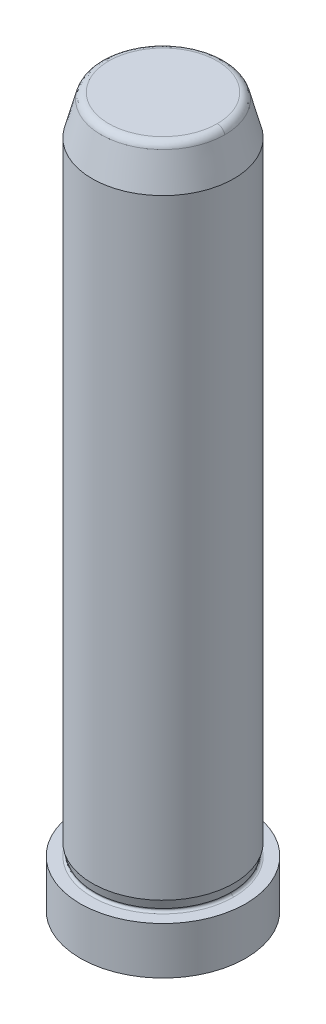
ISO-10303-21;
HEADER;
FILE_DESCRIPTION(('STEP AP214'),'2;1');
FILE_NAME('part.step','',(''),(''),'','','');
FILE_SCHEMA(('AUTOMOTIVE_DESIGN { 1 0 10303 214 1 1 1 1 }'));
ENDSEC;
DATA;
#1=APPLICATION_CONTEXT('core data for automotive mechanical design processes');
#2=APPLICATION_PROTOCOL_DEFINITION('international standard','automotive_design',2000,#1);
#3=PRODUCT_CONTEXT('',#1,'mechanical');
#4=PRODUCT('Part','Part','',(#3));
#5=PRODUCT_RELATED_PRODUCT_CATEGORY('part','',(#4));
#6=PRODUCT_DEFINITION_FORMATION('','',#4);
#7=PRODUCT_DEFINITION_CONTEXT('part definition',#1,'design');
#8=PRODUCT_DEFINITION('design','',#6,#7);
#9=PRODUCT_DEFINITION_SHAPE('','',#8);
#10=(LENGTH_UNIT() NAMED_UNIT(*) SI_UNIT(.MILLI.,.METRE.));
#11=(NAMED_UNIT(*) PLANE_ANGLE_UNIT() SI_UNIT($,.RADIAN.));
#12=(NAMED_UNIT(*) SI_UNIT($,.STERADIAN.) SOLID_ANGLE_UNIT());
#13=UNCERTAINTY_MEASURE_WITH_UNIT(LENGTH_MEASURE(1.E-05),#10,'distance_accuracy_value','');
#14=(GEOMETRIC_REPRESENTATION_CONTEXT(3) GLOBAL_UNCERTAINTY_ASSIGNED_CONTEXT((#13)) GLOBAL_UNIT_ASSIGNED_CONTEXT((#10,
#11,#12)) REPRESENTATION_CONTEXT('',''));
#15=CARTESIAN_POINT('',(0.,0.,0.));
#16=DIRECTION('',(0.,0.,1.));
#17=DIRECTION('',(1.,0.,0.));
#18=AXIS2_PLACEMENT_3D('',#15,#16,#17);
#19=CARTESIAN_POINT('',(-55.626,-159.,-31.374));
#20=DIRECTION('',(0.,-1.,0.));
#21=DIRECTION('',(0.,0.,-1.));
#22=AXIS2_PLACEMENT_3D('',#19,#20,#21);
#23=PLANE('',#22);
#24=CARTESIAN_POINT('',(-45.,-159.,-42.));
#25=DIRECTION('',(0.,-1.,0.));
#26=DIRECTION('',(0.,0.,-1.));
#27=AXIS2_PLACEMENT_3D('',#24,#25,#26);
#28=CIRCLE('',#27,10.5);
#29=CARTESIAN_POINT('',(-45.,-159.,-52.5));
#30=VERTEX_POINT('',#29);
#31=EDGE_CURVE('E29',#30,#30,#28,.T.);
#32=ORIENTED_EDGE('',*,*,#31,.T.);
#33=EDGE_LOOP('',(#32));
#34=FACE_BOUND('',#33,.T.);
#35=ADVANCED_FACE('F24',(#34),#23,.T.);
#36=CARTESIAN_POINT('',(-45.,-153.,-42.));
#37=DIRECTION('',(0.,-1.,0.));
#38=DIRECTION('',(0.,0.,-1.));
#39=AXIS2_PLACEMENT_3D('',#36,#37,#38);
#40=CYLINDRICAL_SURFACE('',#39,10.5);
#41=ORIENTED_EDGE('',*,*,#31,.F.);
#42=EDGE_LOOP('',(#41));
#43=FACE_BOUND('',#42,.T.);
#44=CARTESIAN_POINT('',(-45.,-153.,-42.));
#45=DIRECTION('',(0.,-1.,0.));
#46=DIRECTION('',(0.,0.,-1.));
#47=AXIS2_PLACEMENT_3D('',#44,#45,#46);
#48=CIRCLE('',#47,10.5);
#49=CARTESIAN_POINT('',(-45.,-153.,-52.5));
#50=VERTEX_POINT('',#49);
#51=EDGE_CURVE('E81',#50,#50,#48,.F.);
#52=ORIENTED_EDGE('',*,*,#51,.F.);
#53=EDGE_LOOP('',(#52));
#54=FACE_BOUND('',#53,.T.);
#55=ADVANCED_FACE('F162',(#43,#54),#40,.T.);
#56=CARTESIAN_POINT('',(-34.374,-153.,-52.626));
#57=DIRECTION('',(0.,1.,0.));
#58=DIRECTION('',(-1.,0.,0.));
#59=AXIS2_PLACEMENT_3D('',#56,#57,#58);
#60=PLANE('',#59);
#61=CARTESIAN_POINT('',(-53.9999999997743,-153.000000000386,-42.));
#62=CARTESIAN_POINT('',(-53.9999999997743,-153.000000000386,-24.0000000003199));
#63=CARTESIAN_POINT('',(-36.0000000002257,-153.000000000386,-24.0000000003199));
#64=CARTESIAN_POINT('',(-36.0000000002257,-153.000000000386,-42.));
#65=(BOUNDED_CURVE() B_SPLINE_CURVE(3,(#61,#62,#63,#64),.UNSPECIFIED.,.F.,
.F.) B_SPLINE_CURVE_WITH_KNOTS((4,4),(0.,1.),
.UNSPECIFIED.) CURVE() GEOMETRIC_REPRESENTATION_ITEM() RATIONAL_B_SPLINE_CURVE((0.956578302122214,
0.318859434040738,0.318859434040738,0.956578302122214)) REPRESENTATION_ITEM(''));
#66=CARTESIAN_POINT('',(-35.9999999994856,-153.000000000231,-42.));
#67=VERTEX_POINT('',#66);
#68=CARTESIAN_POINT('',(-54.0000000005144,-153.000000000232,-42.));
#69=VERTEX_POINT('',#68);
#70=EDGE_CURVE('E60',#67,#69,#65,.F.);
#71=ORIENTED_EDGE('',*,*,#70,.T.);
#72=CARTESIAN_POINT('',(-36.0000000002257,-153.000000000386,-42.));
#73=CARTESIAN_POINT('',(-36.0000000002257,-153.000000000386,-59.9999999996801));
#74=CARTESIAN_POINT('',(-53.9999999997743,-153.000000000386,-59.9999999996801));
#75=CARTESIAN_POINT('',(-53.9999999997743,-153.000000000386,-42.));
#76=(BOUNDED_CURVE() B_SPLINE_CURVE(3,(#72,#73,#74,#75),.UNSPECIFIED.,.F.,
.F.) B_SPLINE_CURVE_WITH_KNOTS((4,4),(0.,1.),
.UNSPECIFIED.) CURVE() GEOMETRIC_REPRESENTATION_ITEM() RATIONAL_B_SPLINE_CURVE((0.956578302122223,
0.318859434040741,0.318859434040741,0.956578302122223)) REPRESENTATION_ITEM(''));
#77=EDGE_CURVE('E64',#69,#67,#76,.F.);
#78=ORIENTED_EDGE('',*,*,#77,.T.);
#79=EDGE_LOOP('',(#71,#78));
#80=FACE_BOUND('',#79,.T.);
#81=ORIENTED_EDGE('',*,*,#51,.T.);
#82=EDGE_LOOP('',(#81));
#83=FACE_BOUND('',#82,.T.);
#84=ADVANCED_FACE('F66',(#80,#83),#60,.T.);
#85=CARTESIAN_POINT('',(-54.029950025,-152.99850125,-42.));
#86=CARTESIAN_POINT('',(-54.029950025,-152.99850125,-23.94009995));
#87=CARTESIAN_POINT('',(-35.970049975,-152.99850125,-23.94009995));
#88=CARTESIAN_POINT('',(-35.970049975,-152.99850125,-42.));
#89=CARTESIAN_POINT('',(-53.82598387,-153.018966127,-42.));
#90=CARTESIAN_POINT('',(-53.82598387,-153.018966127,-24.348032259));
#91=CARTESIAN_POINT('',(-36.17401613,-153.018966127,-24.348032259));
#92=CARTESIAN_POINT('',(-36.17401613,-153.018966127,-42.));
#93=CARTESIAN_POINT('',(-53.681033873,-152.87401613,-42.));
#94=CARTESIAN_POINT('',(-53.681033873,-152.87401613,-24.637932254));
#95=CARTESIAN_POINT('',(-36.318966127,-152.87401613,-24.637932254));
#96=CARTESIAN_POINT('',(-36.318966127,-152.87401613,-42.));
#97=CARTESIAN_POINT('',(-53.70149875,-152.670049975,-42.));
#98=CARTESIAN_POINT('',(-53.70149875,-152.670049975,-24.597002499));
#99=CARTESIAN_POINT('',(-36.29850125,-152.670049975,-24.597002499));
#100=CARTESIAN_POINT('',(-36.29850125,-152.670049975,-42.));
#101=(BOUNDED_SURFACE() B_SPLINE_SURFACE(3,3,((#85,#86,#87,#88),(#89,#90,#91,#92),(#93,#94,#95,
#96),(#97,#98,#99,#100)),.UNSPECIFIED.,.F.,.F.,.F.) B_SPLINE_SURFACE_WITH_KNOTS((4,4),(4,4),(0.,
1.),(0.,1.),.UNSPECIFIED.) GEOMETRIC_REPRESENTATION_ITEM() RATIONAL_B_SPLINE_SURFACE(((1.,
0.333333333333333,0.333333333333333,1.),(0.755320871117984,0.251773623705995,0.251773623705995,
0.755320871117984),(0.755320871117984,0.251773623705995,0.251773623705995,0.755320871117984),
(1.,0.333333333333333,0.333333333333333,1.))) REPRESENTATION_ITEM('') SURFACE());
#102=CARTESIAN_POINT('',(-45.,-152.7,-42.));
#103=DIRECTION('',(0.,-1.,0.));
#104=DIRECTION('',(-1.,0.,0.));
#105=AXIS2_PLACEMENT_3D('',#102,#103,#104);
#106=CIRCLE('',#105,8.70000000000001);
#107=CARTESIAN_POINT('',(-36.3000000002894,-152.700000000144,-41.9999999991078));
#108=VERTEX_POINT('',#107);
#109=CARTESIAN_POINT('',(-53.6999999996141,-152.700000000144,-42.));
#110=VERTEX_POINT('',#109);
#111=EDGE_CURVE('E88',#108,#110,#106,.T.);
#112=CARTESIAN_POINT('',(-54.029950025,-152.99850125,-42.));
#113=CARTESIAN_POINT('',(-53.82598387,-153.018966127,-42.));
#114=CARTESIAN_POINT('',(-53.681033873,-152.87401613,-42.));
#115=CARTESIAN_POINT('',(-53.70149875,-152.670049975,-42.));
#116=(BOUNDED_CURVE() B_SPLINE_CURVE(3,(#112,#113,#114,#115),.UNSPECIFIED.,.F.,
.F.) B_SPLINE_CURVE_WITH_KNOTS((4,4),(0.,1.),
.UNSPECIFIED.) CURVE() GEOMETRIC_REPRESENTATION_ITEM() RATIONAL_B_SPLINE_CURVE((1.,
0.755320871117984,0.755320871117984,1.)) REPRESENTATION_ITEM(''));
#117=EDGE_CURVE('E73',#110,#69,#116,.F.);
#118=CARTESIAN_POINT('',(-35.970049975,-152.99850125,-42.));
#119=CARTESIAN_POINT('',(-36.17401613,-153.018966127,-42.));
#120=CARTESIAN_POINT('',(-36.318966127,-152.87401613,-42.));
#121=CARTESIAN_POINT('',(-36.29850125,-152.670049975,-42.));
#122=(BOUNDED_CURVE() B_SPLINE_CURVE(3,(#118,#119,#120,#121),.UNSPECIFIED.,.F.,
.F.) B_SPLINE_CURVE_WITH_KNOTS((4,4),(0.,1.),
.UNSPECIFIED.) CURVE() GEOMETRIC_REPRESENTATION_ITEM() RATIONAL_B_SPLINE_CURVE((1.,
0.755320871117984,0.755320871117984,1.)) REPRESENTATION_ITEM(''));
#123=EDGE_CURVE('E72',#67,#108,#122,.T.);
#124=ORIENTED_EDGE('',*,*,#111,.T.);
#125=ORIENTED_EDGE('',*,*,#117,.T.);
#126=ORIENTED_EDGE('',*,*,#70,.F.);
#127=ORIENTED_EDGE('',*,*,#123,.T.);
#128=EDGE_LOOP('',(#124,#125,#126,#127));
#129=FACE_BOUND('',#128,.T.);
#130=ADVANCED_FACE('F79',(#129),#101,.F.);
#131=CARTESIAN_POINT('',(-35.970049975,-152.99850125,-42.));
#132=CARTESIAN_POINT('',(-35.970049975,-152.99850125,-60.05990005));
#133=CARTESIAN_POINT('',(-54.029950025,-152.99850125,-60.05990005));
#134=CARTESIAN_POINT('',(-54.029950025,-152.99850125,-42.));
#135=CARTESIAN_POINT('',(-36.17401613,-153.018966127,-42.));
#136=CARTESIAN_POINT('',(-36.17401613,-153.018966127,-59.651967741));
#137=CARTESIAN_POINT('',(-53.82598387,-153.018966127,-59.651967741));
#138=CARTESIAN_POINT('',(-53.82598387,-153.018966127,-42.));
#139=CARTESIAN_POINT('',(-36.318966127,-152.87401613,-42.));
#140=CARTESIAN_POINT('',(-36.318966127,-152.87401613,-59.362067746));
#141=CARTESIAN_POINT('',(-53.681033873,-152.87401613,-59.362067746));
#142=CARTESIAN_POINT('',(-53.681033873,-152.87401613,-42.));
#143=CARTESIAN_POINT('',(-36.29850125,-152.670049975,-42.));
#144=CARTESIAN_POINT('',(-36.29850125,-152.670049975,-59.402997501));
#145=CARTESIAN_POINT('',(-53.70149875,-152.670049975,-59.402997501));
#146=CARTESIAN_POINT('',(-53.70149875,-152.670049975,-42.));
#147=(BOUNDED_SURFACE() B_SPLINE_SURFACE(3,3,((#131,#132,#133,#134),(#135,#136,#137,#138),(#139,
#140,#141,#142),(#143,#144,#145,#146)),.UNSPECIFIED.,.F.,.F.,
.F.) B_SPLINE_SURFACE_WITH_KNOTS((4,4),(4,4),(0.,1.),(0.,1.),
.UNSPECIFIED.) GEOMETRIC_REPRESENTATION_ITEM() RATIONAL_B_SPLINE_SURFACE(((1.,0.333333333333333,
0.333333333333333,1.),(0.755320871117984,0.251773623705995,0.251773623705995,0.755320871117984),
(0.755320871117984,0.251773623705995,0.251773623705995,0.755320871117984),(1.,0.333333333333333,
0.333333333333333,1.))) REPRESENTATION_ITEM('') SURFACE());
#148=CARTESIAN_POINT('',(-45.,-152.7,-42.));
#149=DIRECTION('',(0.,-1.,0.));
#150=DIRECTION('',(-1.,0.,0.));
#151=AXIS2_PLACEMENT_3D('',#148,#149,#150);
#152=CIRCLE('',#151,8.70000000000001);
#153=EDGE_CURVE('E86',#110,#108,#152,.T.);
#154=ORIENTED_EDGE('',*,*,#77,.F.);
#155=ORIENTED_EDGE('',*,*,#117,.F.);
#156=ORIENTED_EDGE('',*,*,#153,.T.);
#157=ORIENTED_EDGE('',*,*,#123,.F.);
#158=EDGE_LOOP('',(#154,#155,#156,#157));
#159=FACE_BOUND('',#158,.T.);
#160=ADVANCED_FACE('F84',(#159),#147,.F.);
#161=CARTESIAN_POINT('',(-37.12013394,-69.838905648,-42.));
#162=CARTESIAN_POINT('',(-37.12013394,-69.838905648,-26.24026788));
#163=CARTESIAN_POINT('',(-52.87986606,-69.838905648,-26.24026788));
#164=CARTESIAN_POINT('',(-52.87986606,-69.838905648,-42.));
#165=CARTESIAN_POINT('',(-37.209940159,-69.288710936,-42.));
#166=CARTESIAN_POINT('',(-37.209940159,-69.288710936,-26.419880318));
#167=CARTESIAN_POINT('',(-52.790059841,-69.288710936,-26.419880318));
#168=CARTESIAN_POINT('',(-52.790059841,-69.288710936,-42.));
#169=CARTESIAN_POINT('',(-37.652215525,-68.949341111,-42.));
#170=CARTESIAN_POINT('',(-37.652215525,-68.949341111,-27.304431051));
#171=CARTESIAN_POINT('',(-52.347784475,-68.949341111,-27.304431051));
#172=CARTESIAN_POINT('',(-52.347784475,-68.949341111,-42.));
#173=CARTESIAN_POINT('',(-38.206906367,-69.004995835,-42.));
#174=CARTESIAN_POINT('',(-38.206906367,-69.004995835,-28.413812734));
#175=CARTESIAN_POINT('',(-51.793093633,-69.004995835,-28.413812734));
#176=CARTESIAN_POINT('',(-51.793093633,-69.004995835,-42.));
#177=(BOUNDED_SURFACE() B_SPLINE_SURFACE(3,3,((#161,#162,#163,#164),(#165,#166,#167,#168),(#169,
#170,#171,#172),(#173,#174,#175,#176)),.UNSPECIFIED.,.F.,.F.,
.F.) B_SPLINE_SURFACE_WITH_KNOTS((4,4),(4,4),(0.,1.),(0.,1.),
.UNSPECIFIED.) GEOMETRIC_REPRESENTATION_ITEM() RATIONAL_B_SPLINE_SURFACE(((1.,0.333333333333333,
0.333333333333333,1.),(0.819076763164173,0.273025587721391,0.273025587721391,0.819076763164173),
(0.819076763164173,0.273025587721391,0.273025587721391,0.819076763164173),(1.,0.333333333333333,
0.333333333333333,1.))) REPRESENTATION_ITEM('') SURFACE());
#178=CARTESIAN_POINT('',(-52.87986606,-69.838905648,-42.));
#179=CARTESIAN_POINT('',(-52.790059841,-69.288710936,-42.));
#180=CARTESIAN_POINT('',(-52.347784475,-68.949341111,-42.));
#181=CARTESIAN_POINT('',(-51.793093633,-69.004995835,-42.));
#182=(BOUNDED_CURVE() B_SPLINE_CURVE(3,(#178,#179,#180,#181),.UNSPECIFIED.,.F.,
.F.) B_SPLINE_CURVE_WITH_KNOTS((4,4),(0.,1.),
.UNSPECIFIED.) CURVE() GEOMETRIC_REPRESENTATION_ITEM() RATIONAL_B_SPLINE_CURVE((1.,
0.819076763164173,0.819076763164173,1.)) REPRESENTATION_ITEM(''));
#183=CARTESIAN_POINT('',(-51.8929270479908,-69.0000000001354,-42.));
#184=VERTEX_POINT('',#183);
#185=CARTESIAN_POINT('',(-52.8588528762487,-69.7411809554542,-42.));
#186=VERTEX_POINT('',#185);
#187=EDGE_CURVE('E108',#184,#186,#182,.F.);
#188=CARTESIAN_POINT('',(-45.,-69.741180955,-42.));
#189=DIRECTION('',(0.,-1.,0.));
#190=DIRECTION('',(-1.,0.,0.));
#191=AXIS2_PLACEMENT_3D('',#188,#189,#190);
#192=CIRCLE('',#191,7.858852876);
#193=CARTESIAN_POINT('',(-37.1411471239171,-69.7411809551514,-41.9999999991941));
#194=VERTEX_POINT('',#193);
#195=EDGE_CURVE('E103',#186,#194,#192,.F.);
#196=CARTESIAN_POINT('',(-37.12013394,-69.838905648,-42.));
#197=CARTESIAN_POINT('',(-37.209940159,-69.288710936,-42.));
#198=CARTESIAN_POINT('',(-37.652215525,-68.949341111,-42.));
#199=CARTESIAN_POINT('',(-38.206906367,-69.004995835,-42.));
#200=(BOUNDED_CURVE() B_SPLINE_CURVE(3,(#196,#197,#198,#199),.UNSPECIFIED.,.F.,
.F.) B_SPLINE_CURVE_WITH_KNOTS((4,4),(0.,1.),
.UNSPECIFIED.) CURVE() GEOMETRIC_REPRESENTATION_ITEM() RATIONAL_B_SPLINE_CURVE((1.,
0.819076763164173,0.819076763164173,1.)) REPRESENTATION_ITEM(''));
#201=CARTESIAN_POINT('',(-38.1070729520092,-69.0000000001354,-42.));
#202=VERTEX_POINT('',#201);
#203=EDGE_CURVE('E44',#194,#202,#200,.T.);
#204=CARTESIAN_POINT('',(-38.1070729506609,-69.0000000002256,-42.));
#205=CARTESIAN_POINT('',(-38.1070729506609,-69.0000000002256,-28.2141459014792));
#206=CARTESIAN_POINT('',(-51.8929270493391,-69.0000000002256,-28.2141459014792));
#207=CARTESIAN_POINT('',(-51.8929270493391,-69.0000000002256,-42.));
#208=(BOUNDED_CURVE() B_SPLINE_CURVE(3,(#204,#205,#206,#207),.UNSPECIFIED.,.F.,
.F.) B_SPLINE_CURVE_WITH_KNOTS((4,4),(0.,1.),
.UNSPECIFIED.) CURVE() GEOMETRIC_REPRESENTATION_ITEM() RATIONAL_B_SPLINE_CURVE((0.96390103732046,
0.321300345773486,0.321300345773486,0.96390103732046)) REPRESENTATION_ITEM(''));
#209=EDGE_CURVE('E104',#184,#202,#208,.F.);
#210=ORIENTED_EDGE('',*,*,#187,.T.);
#211=ORIENTED_EDGE('',*,*,#195,.T.);
#212=ORIENTED_EDGE('',*,*,#203,.T.);
#213=ORIENTED_EDGE('',*,*,#209,.F.);
#214=EDGE_LOOP('',(#210,#211,#212,#213));
#215=FACE_BOUND('',#214,.T.);
#216=ADVANCED_FACE('F147',(#215),#177,.T.);
#217=CARTESIAN_POINT('',(-51.975642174,-69.,-35.024357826));
#218=DIRECTION('',(0.,1.,0.));
#219=DIRECTION('',(1.,0.,0.));
#220=AXIS2_PLACEMENT_3D('',#217,#218,#219);
#221=PLANE('',#220);
#222=ORIENTED_EDGE('',*,*,#209,.T.);
#223=CARTESIAN_POINT('',(-51.8929270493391,-69.0000000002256,-42.));
#224=CARTESIAN_POINT('',(-51.8929270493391,-69.0000000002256,-55.7858540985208));
#225=CARTESIAN_POINT('',(-38.1070729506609,-69.0000000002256,-55.7858540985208));
#226=CARTESIAN_POINT('',(-38.1070729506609,-69.0000000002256,-42.));
#227=(BOUNDED_CURVE() B_SPLINE_CURVE(3,(#223,#224,#225,#226),.UNSPECIFIED.,.F.,
.F.) B_SPLINE_CURVE_WITH_KNOTS((4,4),(0.,1.),
.UNSPECIFIED.) CURVE() GEOMETRIC_REPRESENTATION_ITEM() RATIONAL_B_SPLINE_CURVE((0.96390103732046,
0.321300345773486,0.321300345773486,0.96390103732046)) REPRESENTATION_ITEM(''));
#228=EDGE_CURVE('E105',#184,#202,#227,.T.);
#229=ORIENTED_EDGE('',*,*,#228,.F.);
#230=EDGE_LOOP('',(#222,#229));
#231=FACE_BOUND('',#230,.T.);
#232=ADVANCED_FACE('F26',(#231),#221,.T.);
#233=CARTESIAN_POINT('',(-45.,-152.619615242,-42.));
#234=DIRECTION('',(0.,-1.,0.));
#235=DIRECTION('',(0.,0.,-1.));
#236=AXIS2_PLACEMENT_3D('',#233,#234,#235);
#237=CYLINDRICAL_SURFACE('',#236,8.70000000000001);
#238=CARTESIAN_POINT('',(-45.,-152.619615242,-42.));
#239=DIRECTION('',(0.,1.,0.));
#240=DIRECTION('',(-1.,0.,0.));
#241=AXIS2_PLACEMENT_3D('',#238,#239,#240);
#242=CIRCLE('',#241,8.70000000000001);
#243=CARTESIAN_POINT('',(-53.7,-152.619615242,-42.));
#244=VERTEX_POINT('',#243);
#245=EDGE_CURVE('E131',#244,#244,#242,.F.);
#246=ORIENTED_EDGE('',*,*,#245,.T.);
#247=EDGE_LOOP('',(#246));
#248=FACE_BOUND('',#247,.T.);
#249=ORIENTED_EDGE('',*,*,#111,.F.);
#250=ORIENTED_EDGE('',*,*,#153,.F.);
#251=EDGE_LOOP('',(#249,#250));
#252=FACE_BOUND('',#251,.T.);
#253=ADVANCED_FACE('F245',(#248,#252),#237,.T.);
#254=CARTESIAN_POINT('',(-52.87986606,-69.838905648,-42.));
#255=CARTESIAN_POINT('',(-52.87986606,-69.838905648,-57.75973212));
#256=CARTESIAN_POINT('',(-37.12013394,-69.838905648,-57.75973212));
#257=CARTESIAN_POINT('',(-37.12013394,-69.838905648,-42.));
#258=CARTESIAN_POINT('',(-52.790059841,-69.288710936,-42.));
#259=CARTESIAN_POINT('',(-52.790059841,-69.288710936,-57.580119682));
#260=CARTESIAN_POINT('',(-37.209940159,-69.288710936,-57.580119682));
#261=CARTESIAN_POINT('',(-37.209940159,-69.288710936,-42.));
#262=CARTESIAN_POINT('',(-52.347784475,-68.949341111,-42.));
#263=CARTESIAN_POINT('',(-52.347784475,-68.949341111,-56.695568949));
#264=CARTESIAN_POINT('',(-37.652215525,-68.949341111,-56.695568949));
#265=CARTESIAN_POINT('',(-37.652215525,-68.949341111,-42.));
#266=CARTESIAN_POINT('',(-51.793093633,-69.004995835,-42.));
#267=CARTESIAN_POINT('',(-51.793093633,-69.004995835,-55.586187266));
#268=CARTESIAN_POINT('',(-38.206906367,-69.004995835,-55.586187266));
#269=CARTESIAN_POINT('',(-38.206906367,-69.004995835,-42.));
#270=(BOUNDED_SURFACE() B_SPLINE_SURFACE(3,3,((#254,#255,#256,#257),(#258,#259,#260,#261),(#262,
#263,#264,#265),(#266,#267,#268,#269)),.UNSPECIFIED.,.F.,.F.,
.F.) B_SPLINE_SURFACE_WITH_KNOTS((4,4),(4,4),(0.,1.),(0.,1.),
.UNSPECIFIED.) GEOMETRIC_REPRESENTATION_ITEM() RATIONAL_B_SPLINE_SURFACE(((1.,0.333333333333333,
0.333333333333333,1.),(0.819076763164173,0.273025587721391,0.273025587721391,0.819076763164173),
(0.819076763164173,0.273025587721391,0.273025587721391,0.819076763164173),(1.,0.333333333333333,
0.333333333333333,1.))) REPRESENTATION_ITEM('') SURFACE());
#271=CARTESIAN_POINT('',(-45.,-69.741180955,-42.));
#272=DIRECTION('',(0.,-1.,0.));
#273=DIRECTION('',(-1.,0.,0.));
#274=AXIS2_PLACEMENT_3D('',#271,#272,#273);
#275=CIRCLE('',#274,7.858852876);
#276=EDGE_CURVE('E130',#194,#186,#275,.F.);
#277=ORIENTED_EDGE('',*,*,#276,.T.);
#278=ORIENTED_EDGE('',*,*,#187,.F.);
#279=ORIENTED_EDGE('',*,*,#228,.T.);
#280=ORIENTED_EDGE('',*,*,#203,.F.);
#281=EDGE_LOOP('',(#277,#278,#279,#280));
#282=FACE_BOUND('',#281,.T.);
#283=ADVANCED_FACE('F239',(#282),#270,.T.);
#284=CARTESIAN_POINT('',(-45.,-152.619615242,-42.));
#285=DIRECTION('',(0.,1.,0.));
#286=DIRECTION('',(0.,0.,1.));
#287=AXIS2_PLACEMENT_3D('',#284,#285,#286);
#288=CONICAL_SURFACE('',#287,8.70000000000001,0.261799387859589);
#289=CARTESIAN_POINT('',(-45.,-151.5,-42.));
#290=DIRECTION('',(0.,-1.,0.));
#291=DIRECTION('',(-1.,0.,0.));
#292=AXIS2_PLACEMENT_3D('',#289,#290,#291);
#293=CIRCLE('',#292,9.);
#294=CARTESIAN_POINT('',(-54.,-151.5,-42.));
#295=VERTEX_POINT('',#294);
#296=EDGE_CURVE('E35',#295,#295,#293,.T.);
#297=ORIENTED_EDGE('',*,*,#296,.T.);
#298=EDGE_LOOP('',(#297));
#299=FACE_BOUND('',#298,.T.);
#300=ORIENTED_EDGE('',*,*,#245,.F.);
#301=EDGE_LOOP('',(#300));
#302=FACE_BOUND('',#301,.T.);
#303=ADVANCED_FACE('F231',(#299,#302),#288,.T.);
#304=CARTESIAN_POINT('',(-45.,-69.741180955,-42.));
#305=DIRECTION('',(0.,-1.,0.));
#306=DIRECTION('',(0.,0.,-1.));
#307=AXIS2_PLACEMENT_3D('',#304,#305,#306);
#308=CONICAL_SURFACE('',#307,7.858852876,0.261799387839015);
#309=CARTESIAN_POINT('',(-45.,-74.,-42.));
#310=DIRECTION('',(0.,-1.,0.));
#311=DIRECTION('',(-1.,0.,0.));
#312=AXIS2_PLACEMENT_3D('',#309,#310,#311);
#313=CIRCLE('',#312,9.);
#314=CARTESIAN_POINT('',(-54.,-74.,-42.));
#315=VERTEX_POINT('',#314);
#316=EDGE_CURVE('E13',#315,#315,#313,.F.);
#317=ORIENTED_EDGE('',*,*,#316,.T.);
#318=EDGE_LOOP('',(#317));
#319=FACE_BOUND('',#318,.T.);
#320=ORIENTED_EDGE('',*,*,#276,.F.);
#321=ORIENTED_EDGE('',*,*,#195,.F.);
#322=EDGE_LOOP('',(#320,#321));
#323=FACE_BOUND('',#322,.T.);
#324=ADVANCED_FACE('F225',(#319,#323),#308,.T.);
#325=CARTESIAN_POINT('',(-45.,-74.,-42.));
#326=DIRECTION('',(0.,-1.,0.));
#327=DIRECTION('',(0.,0.,-1.));
#328=AXIS2_PLACEMENT_3D('',#325,#326,#327);
#329=CYLINDRICAL_SURFACE('',#328,9.);
#330=ORIENTED_EDGE('',*,*,#296,.F.);
#331=EDGE_LOOP('',(#330));
#332=FACE_BOUND('',#331,.T.);
#333=ORIENTED_EDGE('',*,*,#316,.F.);
#334=EDGE_LOOP('',(#333));
#335=FACE_BOUND('',#334,.T.);
#336=ADVANCED_FACE('F223',(#332,#335),#329,.T.);
#337=CLOSED_SHELL('',(#35,#55,#84,#130,#160,#216,#232,#253,#283,#303,#324,#336));
#338=MANIFOLD_SOLID_BREP('B1',#337);
#339=ADVANCED_BREP_SHAPE_REPRESENTATION('',(#18,#338),#14);
#340=SHAPE_DEFINITION_REPRESENTATION(#9,#339);
ENDSEC;
END-ISO-10303-21;
